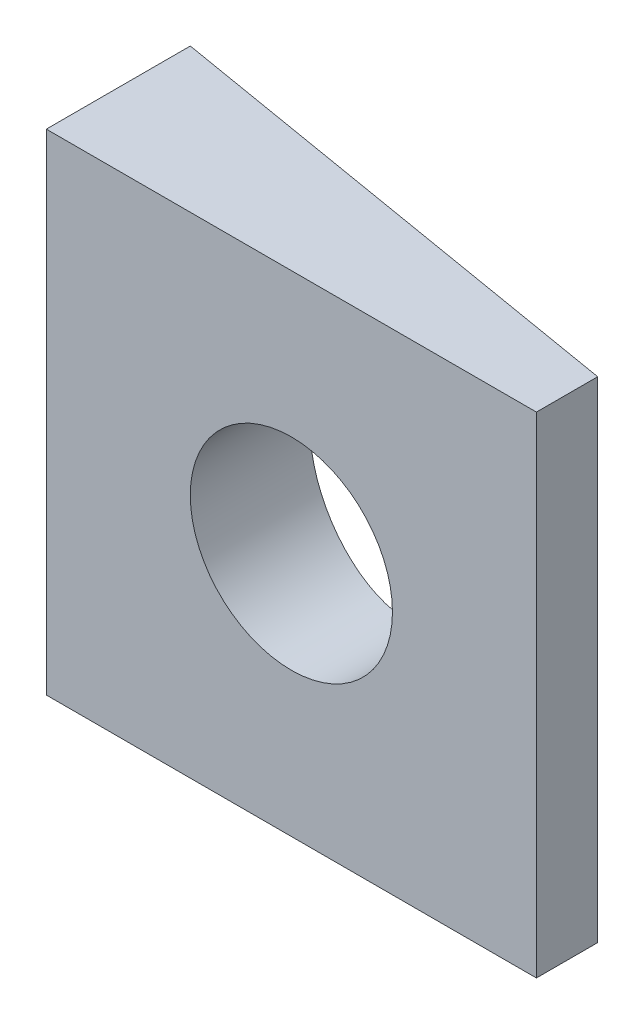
ISO-10303-21;
HEADER;
FILE_DESCRIPTION(('STEP AP214'),'2;1');
FILE_NAME('part.step','',(''),(''),'','','');
FILE_SCHEMA(('AUTOMOTIVE_DESIGN { 1 0 10303 214 1 1 1 1 }'));
ENDSEC;
DATA;
#1=APPLICATION_CONTEXT('core data for automotive mechanical design processes');
#2=APPLICATION_PROTOCOL_DEFINITION('international standard','automotive_design',2000,#1);
#3=PRODUCT_CONTEXT('',#1,'mechanical');
#4=PRODUCT('Part','Part','',(#3));
#5=PRODUCT_RELATED_PRODUCT_CATEGORY('part','',(#4));
#6=PRODUCT_DEFINITION_FORMATION('','',#4);
#7=PRODUCT_DEFINITION_CONTEXT('part definition',#1,'design');
#8=PRODUCT_DEFINITION('design','',#6,#7);
#9=PRODUCT_DEFINITION_SHAPE('','',#8);
#10=(LENGTH_UNIT() NAMED_UNIT(*) SI_UNIT(.MILLI.,.METRE.));
#11=(NAMED_UNIT(*) PLANE_ANGLE_UNIT() SI_UNIT($,.RADIAN.));
#12=(NAMED_UNIT(*) SI_UNIT($,.STERADIAN.) SOLID_ANGLE_UNIT());
#13=UNCERTAINTY_MEASURE_WITH_UNIT(LENGTH_MEASURE(1.E-05),#10,'distance_accuracy_value','');
#14=(GEOMETRIC_REPRESENTATION_CONTEXT(3) GLOBAL_UNCERTAINTY_ASSIGNED_CONTEXT((#13)) GLOBAL_UNIT_ASSIGNED_CONTEXT((#10,
#11,#12)) REPRESENTATION_CONTEXT('',''));
#15=CARTESIAN_POINT('',(0.,0.,0.));
#16=DIRECTION('',(0.,0.,1.));
#17=DIRECTION('',(1.,0.,0.));
#18=AXIS2_PLACEMENT_3D('',#15,#16,#17);
#19=CARTESIAN_POINT('',(7.99999999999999,-7.99999999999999,-4.7));
#20=DIRECTION('',(1.,0.,0.));
#21=DIRECTION('',(0.,1.,0.));
#22=AXIS2_PLACEMENT_3D('',#19,#20,#21);
#23=PLANE('',#22);
#24=DIRECTION('',(0.,1.,0.));
#25=VECTOR('',#24,1.);
#26=CARTESIAN_POINT('',(7.99999999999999,-8.00000000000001,-2.));
#27=LINE('',#26,#25);
#28=CARTESIAN_POINT('',(7.99999999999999,-8.00000000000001,-2.));
#29=VERTEX_POINT('',#28);
#30=CARTESIAN_POINT('',(7.99999999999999,7.99999999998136,-2.));
#31=VERTEX_POINT('',#30);
#32=EDGE_CURVE('E96',#29,#31,#27,.T.);
#33=ORIENTED_EDGE('',*,*,#32,.T.);
#34=DIRECTION('',(0.,0.,1.));
#35=VECTOR('',#34,1.);
#36=CARTESIAN_POINT('',(7.99999999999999,8.,-4.7));
#37=LINE('',#36,#35);
#38=CARTESIAN_POINT('',(7.99999999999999,8.,0.));
#39=VERTEX_POINT('',#38);
#40=EDGE_CURVE('E88',#31,#39,#37,.T.);
#41=ORIENTED_EDGE('',*,*,#40,.T.);
#42=DIRECTION('',(0.,1.,0.));
#43=VECTOR('',#42,1.);
#44=CARTESIAN_POINT('',(7.99999999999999,-7.99999999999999,0.));
#45=LINE('',#44,#43);
#46=CARTESIAN_POINT('',(7.99999999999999,-7.99999999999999,0.));
#47=VERTEX_POINT('',#46);
#48=EDGE_CURVE('E95',#47,#39,#45,.T.);
#49=ORIENTED_EDGE('',*,*,#48,.F.);
#50=DIRECTION('',(0.,0.,1.));
#51=VECTOR('',#50,1.);
#52=CARTESIAN_POINT('',(7.99999999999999,-7.99999999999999,-4.7));
#53=LINE('',#52,#51);
#54=EDGE_CURVE('E11',#29,#47,#53,.T.);
#55=ORIENTED_EDGE('',*,*,#54,.F.);
#56=EDGE_LOOP('',(#33,#41,#49,#55));
#57=FACE_BOUND('',#56,.T.);
#58=ADVANCED_FACE('F32',(#57),#23,.T.);
#59=CARTESIAN_POINT('',(-8.,-8.00000000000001,-4.7));
#60=DIRECTION('',(0.,-1.,0.));
#61=DIRECTION('',(1.,0.,0.));
#62=AXIS2_PLACEMENT_3D('',#59,#60,#61);
#63=PLANE('',#62);
#64=DIRECTION('',(0.986058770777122,0.,0.166397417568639));
#65=VECTOR('',#64,1.);
#66=CARTESIAN_POINT('',(-8.00000000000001,-8.00000000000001,-4.7));
#67=LINE('',#66,#65);
#68=CARTESIAN_POINT('',(-8.,-8.00000000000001,-4.7));
#69=VERTEX_POINT('',#68);
#70=EDGE_CURVE('E49',#69,#29,#67,.T.);
#71=ORIENTED_EDGE('',*,*,#70,.T.);
#72=ORIENTED_EDGE('',*,*,#54,.T.);
#73=DIRECTION('',(1.,0.,0.));
#74=VECTOR('',#73,1.);
#75=CARTESIAN_POINT('',(-8.,-8.00000000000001,0.));
#76=LINE('',#75,#74);
#77=CARTESIAN_POINT('',(-8.,-8.00000000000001,0.));
#78=VERTEX_POINT('',#77);
#79=EDGE_CURVE('E80',#78,#47,#76,.T.);
#80=ORIENTED_EDGE('',*,*,#79,.F.);
#81=DIRECTION('',(0.,0.,1.));
#82=VECTOR('',#81,1.);
#83=CARTESIAN_POINT('',(-8.,-8.00000000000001,-4.7));
#84=LINE('',#83,#82);
#85=EDGE_CURVE('E41',#69,#78,#84,.T.);
#86=ORIENTED_EDGE('',*,*,#85,.F.);
#87=EDGE_LOOP('',(#71,#72,#80,#86));
#88=FACE_BOUND('',#87,.T.);
#89=ADVANCED_FACE('F84',(#88),#63,.T.);
#90=CARTESIAN_POINT('',(-8.00000000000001,8.,-4.7));
#91=DIRECTION('',(-1.,0.,0.));
#92=DIRECTION('',(0.,-1.,0.));
#93=AXIS2_PLACEMENT_3D('',#90,#91,#92);
#94=PLANE('',#93);
#95=DIRECTION('',(0.,-1.,0.));
#96=VECTOR('',#95,1.);
#97=CARTESIAN_POINT('',(-8.00000000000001,8.,0.));
#98=LINE('',#97,#96);
#99=CARTESIAN_POINT('',(-8.00000000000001,8.,0.));
#100=VERTEX_POINT('',#99);
#101=EDGE_CURVE('E69',#100,#78,#98,.T.);
#102=ORIENTED_EDGE('',*,*,#101,.F.);
#103=DIRECTION('',(0.,0.,1.));
#104=VECTOR('',#103,1.);
#105=CARTESIAN_POINT('',(-8.00000000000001,8.,-4.7));
#106=LINE('',#105,#104);
#107=CARTESIAN_POINT('',(-8.00000000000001,7.99999999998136,-4.7));
#108=VERTEX_POINT('',#107);
#109=EDGE_CURVE('E74',#108,#100,#106,.T.);
#110=ORIENTED_EDGE('',*,*,#109,.F.);
#111=DIRECTION('',(0.,-1.,0.));
#112=VECTOR('',#111,1.);
#113=CARTESIAN_POINT('',(-8.00000000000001,8.,-4.7));
#114=LINE('',#113,#112);
#115=EDGE_CURVE('E71',#108,#69,#114,.T.);
#116=ORIENTED_EDGE('',*,*,#115,.T.);
#117=ORIENTED_EDGE('',*,*,#85,.T.);
#118=EDGE_LOOP('',(#102,#110,#116,#117));
#119=FACE_BOUND('',#118,.T.);
#120=ADVANCED_FACE('F67',(#119),#94,.T.);
#121=CARTESIAN_POINT('',(7.99999999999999,8.,-4.7));
#122=DIRECTION('',(0.,1.,0.));
#123=DIRECTION('',(0.,0.,1.));
#124=AXIS2_PLACEMENT_3D('',#121,#122,#123);
#125=PLANE('',#124);
#126=DIRECTION('',(0.986058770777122,0.,0.166397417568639));
#127=VECTOR('',#126,1.);
#128=CARTESIAN_POINT('',(-8.00000000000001,7.99999999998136,-4.7));
#129=LINE('',#128,#127);
#130=EDGE_CURVE('E106',#108,#31,#129,.T.);
#131=ORIENTED_EDGE('',*,*,#130,.F.);
#132=ORIENTED_EDGE('',*,*,#109,.T.);
#133=DIRECTION('',(-1.,0.,0.));
#134=VECTOR('',#133,1.);
#135=CARTESIAN_POINT('',(7.99999999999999,8.,0.));
#136=LINE('',#135,#134);
#137=EDGE_CURVE('E82',#39,#100,#136,.T.);
#138=ORIENTED_EDGE('',*,*,#137,.F.);
#139=ORIENTED_EDGE('',*,*,#40,.F.);
#140=EDGE_LOOP('',(#131,#132,#138,#139));
#141=FACE_BOUND('',#140,.T.);
#142=ADVANCED_FACE('F99',(#141),#125,.T.);
#143=CARTESIAN_POINT('',(7.99999999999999,8.,0.));
#144=DIRECTION('',(0.,0.,1.));
#145=DIRECTION('',(1.,0.,0.));
#146=AXIS2_PLACEMENT_3D('',#143,#144,#145);
#147=PLANE('',#146);
#148=CARTESIAN_POINT('',(0.,0.,0.));
#149=DIRECTION('',(0.,0.,1.));
#150=DIRECTION('',(1.,0.,0.));
#151=AXIS2_PLACEMENT_3D('',#148,#149,#150);
#152=CIRCLE('',#151,3.3);
#153=CARTESIAN_POINT('',(3.3,0.,0.));
#154=VERTEX_POINT('',#153);
#155=EDGE_CURVE('E100',#154,#154,#152,.T.);
#156=ORIENTED_EDGE('',*,*,#155,.F.);
#157=EDGE_LOOP('',(#156));
#158=FACE_BOUND('',#157,.T.);
#159=ORIENTED_EDGE('',*,*,#48,.T.);
#160=ORIENTED_EDGE('',*,*,#137,.T.);
#161=ORIENTED_EDGE('',*,*,#101,.T.);
#162=ORIENTED_EDGE('',*,*,#79,.T.);
#163=EDGE_LOOP('',(#159,#160,#161,#162));
#164=FACE_BOUND('',#163,.T.);
#165=ADVANCED_FACE('F79',(#158,#164),#147,.T.);
#166=CARTESIAN_POINT('',(0.,0.,-4.7));
#167=DIRECTION('',(0.,0.,1.));
#168=DIRECTION('',(1.,0.,0.));
#169=AXIS2_PLACEMENT_3D('',#166,#167,#168);
#170=CYLINDRICAL_SURFACE('',#169,3.3);
#171=CARTESIAN_POINT('',(0.,0.,-3.35));
#172=DIRECTION('',(-0.166397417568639,0.,0.986058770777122));
#173=DIRECTION('',(0.986058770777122,0.,0.166397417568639));
#174=AXIS2_PLACEMENT_3D('',#171,#172,#173);
#175=ELLIPSE('',#174,3.34665650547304,3.3);
#176=CARTESIAN_POINT('',(3.3,0.,-2.793125));
#177=VERTEX_POINT('',#176);
#178=EDGE_CURVE('E35',#177,#177,#175,.F.);
#179=ORIENTED_EDGE('',*,*,#178,.T.);
#180=EDGE_LOOP('',(#179));
#181=FACE_BOUND('',#180,.T.);
#182=ORIENTED_EDGE('',*,*,#155,.T.);
#183=EDGE_LOOP('',(#182));
#184=FACE_BOUND('',#183,.T.);
#185=ADVANCED_FACE('F114',(#181,#184),#170,.F.);
#186=CARTESIAN_POINT('',(-8.00000000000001,-8.00000000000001,-4.7));
#187=DIRECTION('',(-0.166397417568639,0.,0.986058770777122));
#188=DIRECTION('',(0.986058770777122,0.,0.166397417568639));
#189=AXIS2_PLACEMENT_3D('',#186,#187,#188);
#190=PLANE('',#189);
#191=ORIENTED_EDGE('',*,*,#130,.T.);
#192=ORIENTED_EDGE('',*,*,#32,.F.);
#193=ORIENTED_EDGE('',*,*,#70,.F.);
#194=ORIENTED_EDGE('',*,*,#115,.F.);
#195=EDGE_LOOP('',(#191,#192,#193,#194));
#196=FACE_BOUND('',#195,.T.);
#197=ORIENTED_EDGE('',*,*,#178,.F.);
#198=EDGE_LOOP('',(#197));
#199=FACE_BOUND('',#198,.T.);
#200=ADVANCED_FACE('F111',(#196,#199),#190,.F.);
#201=CLOSED_SHELL('',(#58,#89,#120,#142,#165,#185,#200));
#202=MANIFOLD_SOLID_BREP('B2',#201);
#203=ADVANCED_BREP_SHAPE_REPRESENTATION('',(#18,#202),#14);
#204=SHAPE_DEFINITION_REPRESENTATION(#9,#203);
ENDSEC;
END-ISO-10303-21;
